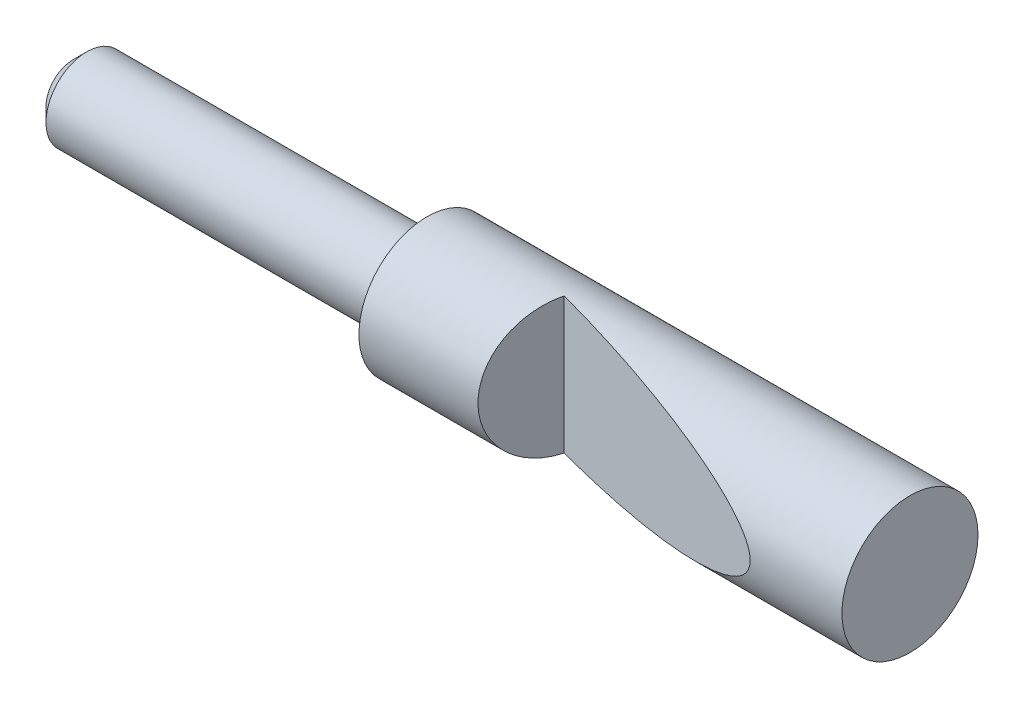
ISO-10303-21;
HEADER;
FILE_DESCRIPTION(('STEP AP214'),'2;1');
FILE_NAME('part.step','',(''),(''),'','','');
FILE_SCHEMA(('AUTOMOTIVE_DESIGN { 1 0 10303 214 1 1 1 1 }'));
ENDSEC;
DATA;
#1=APPLICATION_CONTEXT('core data for automotive mechanical design processes');
#2=APPLICATION_PROTOCOL_DEFINITION('international standard','automotive_design',2000,#1);
#3=PRODUCT_CONTEXT('',#1,'mechanical');
#4=PRODUCT('Part','Part','',(#3));
#5=PRODUCT_RELATED_PRODUCT_CATEGORY('part','',(#4));
#6=PRODUCT_DEFINITION_FORMATION('','',#4);
#7=PRODUCT_DEFINITION_CONTEXT('part definition',#1,'design');
#8=PRODUCT_DEFINITION('design','',#6,#7);
#9=PRODUCT_DEFINITION_SHAPE('','',#8);
#10=(LENGTH_UNIT() NAMED_UNIT(*) SI_UNIT(.MILLI.,.METRE.));
#11=(NAMED_UNIT(*) PLANE_ANGLE_UNIT() SI_UNIT($,.RADIAN.));
#12=(NAMED_UNIT(*) SI_UNIT($,.STERADIAN.) SOLID_ANGLE_UNIT());
#13=UNCERTAINTY_MEASURE_WITH_UNIT(LENGTH_MEASURE(1.E-05),#10,'distance_accuracy_value','');
#14=(GEOMETRIC_REPRESENTATION_CONTEXT(3) GLOBAL_UNCERTAINTY_ASSIGNED_CONTEXT((#13)) GLOBAL_UNIT_ASSIGNED_CONTEXT((#10,
#11,#12)) REPRESENTATION_CONTEXT('',''));
#15=CARTESIAN_POINT('',(0.,0.,0.));
#16=DIRECTION('',(0.,0.,1.));
#17=DIRECTION('',(1.,0.,0.));
#18=AXIS2_PLACEMENT_3D('',#15,#16,#17);
#19=CARTESIAN_POINT('',(0.,0.,0.));
#20=DIRECTION('',(1.,0.,0.));
#21=DIRECTION('',(0.,0.,-1.));
#22=AXIS2_PLACEMENT_3D('',#19,#20,#21);
#23=PLANE('',#22);
#24=CARTESIAN_POINT('',(0.,0.,0.));
#25=DIRECTION('',(1.,0.,0.));
#26=DIRECTION('',(0.,0.,-1.));
#27=AXIS2_PLACEMENT_3D('',#24,#25,#26);
#28=CIRCLE('',#27,10.);
#29=CARTESIAN_POINT('',(0.,0.,-10.));
#30=VERTEX_POINT('',#29);
#31=EDGE_CURVE('E40',#30,#30,#28,.T.);
#32=ORIENTED_EDGE('',*,*,#31,.T.);
#33=EDGE_LOOP('',(#32));
#34=FACE_BOUND('',#33,.T.);
#35=ADVANCED_FACE('F14',(#34),#23,.T.);
#36=CARTESIAN_POINT('',(-50.8205080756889,-10.,0.));
#37=DIRECTION('',(0.258819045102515,0.,-0.96592582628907));
#38=DIRECTION('',(-0.96592582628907,0.,-0.258819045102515));
#39=AXIS2_PLACEMENT_3D('',#36,#37,#38);
#40=PLANE('',#39);
#41=CARTESIAN_POINT('',(-50.8205080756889,0.,0.));
#42=DIRECTION('',(0.258819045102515,0.,-0.96592582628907));
#43=DIRECTION('',(0.96592582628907,0.,0.258819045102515));
#44=AXIS2_PLACEMENT_3D('',#41,#42,#43);
#45=ELLIPSE('',#44,38.6370330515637,10.);
#46=CARTESIAN_POINT('',(-50.8205080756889,-10.,0.));
#47=VERTEX_POINT('',#46);
#48=CARTESIAN_POINT('',(-50.8205080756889,10.,0.));
#49=VERTEX_POINT('',#48);
#50=EDGE_CURVE('E36',#47,#49,#45,.F.);
#51=ORIENTED_EDGE('',*,*,#50,.T.);
#52=DIRECTION('',(0.,1.,0.));
#53=VECTOR('',#52,1.);
#54=CARTESIAN_POINT('',(-50.8205080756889,-10.,0.));
#55=LINE('',#54,#53);
#56=EDGE_CURVE('E28',#47,#49,#55,.T.);
#57=ORIENTED_EDGE('',*,*,#56,.F.);
#58=EDGE_LOOP('',(#51,#57));
#59=FACE_BOUND('',#58,.T.);
#60=ADVANCED_FACE('F39',(#59),#40,.F.);
#61=CARTESIAN_POINT('',(-53.5,-10.,10.));
#62=DIRECTION('',(-0.965925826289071,0.,-0.25881904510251));
#63=DIRECTION('',(-0.25881904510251,0.,0.965925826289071));
#64=AXIS2_PLACEMENT_3D('',#61,#62,#63);
#65=PLANE('',#64);
#66=ORIENTED_EDGE('',*,*,#56,.T.);
#67=CARTESIAN_POINT('',(-50.8205080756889,0.,0.));
#68=DIRECTION('',(-0.965925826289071,0.,-0.25881904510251));
#69=DIRECTION('',(0.25881904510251,0.,-0.965925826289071));
#70=AXIS2_PLACEMENT_3D('',#67,#68,#69);
#71=ELLIPSE('',#70,10.3527618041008,10.);
#72=EDGE_CURVE('E33',#49,#47,#71,.F.);
#73=ORIENTED_EDGE('',*,*,#72,.T.);
#74=EDGE_LOOP('',(#66,#73));
#75=FACE_BOUND('',#74,.T.);
#76=ADVANCED_FACE('F42',(#75),#65,.F.);
#77=CARTESIAN_POINT('',(0.,0.,0.));
#78=DIRECTION('',(1.,0.,0.));
#79=DIRECTION('',(0.,0.,-1.));
#80=AXIS2_PLACEMENT_3D('',#77,#78,#79);
#81=CYLINDRICAL_SURFACE('',#80,10.);
#82=ORIENTED_EDGE('',*,*,#72,.F.);
#83=ORIENTED_EDGE('',*,*,#50,.F.);
#84=EDGE_LOOP('',(#82,#83));
#85=FACE_BOUND('',#84,.T.);
#86=CARTESIAN_POINT('',(-71.,0.,0.));
#87=DIRECTION('',(1.,0.,0.));
#88=DIRECTION('',(0.,0.,-1.));
#89=AXIS2_PLACEMENT_3D('',#86,#87,#88);
#90=CIRCLE('',#89,10.);
#91=CARTESIAN_POINT('',(-71.,0.,-10.));
#92=VERTEX_POINT('',#91);
#93=EDGE_CURVE('E43',#92,#92,#90,.T.);
#94=ORIENTED_EDGE('',*,*,#93,.T.);
#95=EDGE_LOOP('',(#94));
#96=FACE_BOUND('',#95,.T.);
#97=ORIENTED_EDGE('',*,*,#31,.F.);
#98=EDGE_LOOP('',(#97));
#99=FACE_BOUND('',#98,.T.);
#100=ADVANCED_FACE('F34',(#85,#96,#99),#81,.T.);
#101=CARTESIAN_POINT('',(-71.,10.,0.));
#102=DIRECTION('',(-1.,0.,0.));
#103=DIRECTION('',(0.,0.,1.));
#104=AXIS2_PLACEMENT_3D('',#101,#102,#103);
#105=PLANE('',#104);
#106=CARTESIAN_POINT('',(-71.,0.,0.));
#107=DIRECTION('',(-1.,0.,0.));
#108=DIRECTION('',(0.,-1.,0.));
#109=AXIS2_PLACEMENT_3D('',#106,#107,#108);
#110=CIRCLE('',#109,6.);
#111=CARTESIAN_POINT('',(-71.,-6.,0.));
#112=VERTEX_POINT('',#111);
#113=EDGE_CURVE('E9',#112,#112,#110,.F.);
#114=ORIENTED_EDGE('',*,*,#113,.T.);
#115=EDGE_LOOP('',(#114));
#116=FACE_BOUND('',#115,.T.);
#117=ORIENTED_EDGE('',*,*,#93,.F.);
#118=EDGE_LOOP('',(#117));
#119=FACE_BOUND('',#118,.T.);
#120=ADVANCED_FACE('F64',(#116,#119),#105,.T.);
#121=CARTESIAN_POINT('',(-123.,0.,0.));
#122=DIRECTION('',(-1.,0.,0.));
#123=DIRECTION('',(0.,-1.,0.));
#124=AXIS2_PLACEMENT_3D('',#121,#122,#123);
#125=CYLINDRICAL_SURFACE('',#124,6.);
#126=CARTESIAN_POINT('',(-121.,0.,0.));
#127=DIRECTION('',(1.,0.,0.));
#128=DIRECTION('',(0.,0.,1.));
#129=AXIS2_PLACEMENT_3D('',#126,#127,#128);
#130=CIRCLE('',#129,6.);
#131=CARTESIAN_POINT('',(-121.,0.,6.));
#132=VERTEX_POINT('',#131);
#133=EDGE_CURVE('E44',#132,#132,#130,.T.);
#134=ORIENTED_EDGE('',*,*,#133,.T.);
#135=EDGE_LOOP('',(#134));
#136=FACE_BOUND('',#135,.T.);
#137=ORIENTED_EDGE('',*,*,#113,.F.);
#138=EDGE_LOOP('',(#137));
#139=FACE_BOUND('',#138,.T.);
#140=ADVANCED_FACE('F16',(#136,#139),#125,.T.);
#141=CARTESIAN_POINT('',(-123.,0.,4.));
#142=DIRECTION('',(-1.,0.,0.));
#143=DIRECTION('',(0.,-1.,0.));
#144=AXIS2_PLACEMENT_3D('',#141,#142,#143);
#145=PLANE('',#144);
#146=CARTESIAN_POINT('',(-123.,0.,0.));
#147=DIRECTION('',(-1.,0.,0.));
#148=DIRECTION('',(0.,-1.,0.));
#149=AXIS2_PLACEMENT_3D('',#146,#147,#148);
#150=CIRCLE('',#149,4.);
#151=CARTESIAN_POINT('',(-123.,-4.,0.));
#152=VERTEX_POINT('',#151);
#153=EDGE_CURVE('E22',#152,#152,#150,.T.);
#154=ORIENTED_EDGE('',*,*,#153,.T.);
#155=EDGE_LOOP('',(#154));
#156=FACE_BOUND('',#155,.T.);
#157=ADVANCED_FACE('F55',(#156),#145,.T.);
#158=CARTESIAN_POINT('',(-123.,0.,0.));
#159=DIRECTION('',(1.,0.,0.));
#160=DIRECTION('',(0.,1.,0.));
#161=AXIS2_PLACEMENT_3D('',#158,#159,#160);
#162=CONICAL_SURFACE('',#161,4.,0.785398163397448);
#163=ORIENTED_EDGE('',*,*,#153,.F.);
#164=EDGE_LOOP('',(#163));
#165=FACE_BOUND('',#164,.T.);
#166=ORIENTED_EDGE('',*,*,#133,.F.);
#167=EDGE_LOOP('',(#166));
#168=FACE_BOUND('',#167,.T.);
#169=ADVANCED_FACE('F57',(#165,#168),#162,.T.);
#170=CLOSED_SHELL('',(#35,#60,#76,#100,#120,#140,#157,#169));
#171=MANIFOLD_SOLID_BREP('B1',#170);
#172=ADVANCED_BREP_SHAPE_REPRESENTATION('',(#18,#171),#14);
#173=SHAPE_DEFINITION_REPRESENTATION(#9,#172);
ENDSEC;
END-ISO-10303-21;
